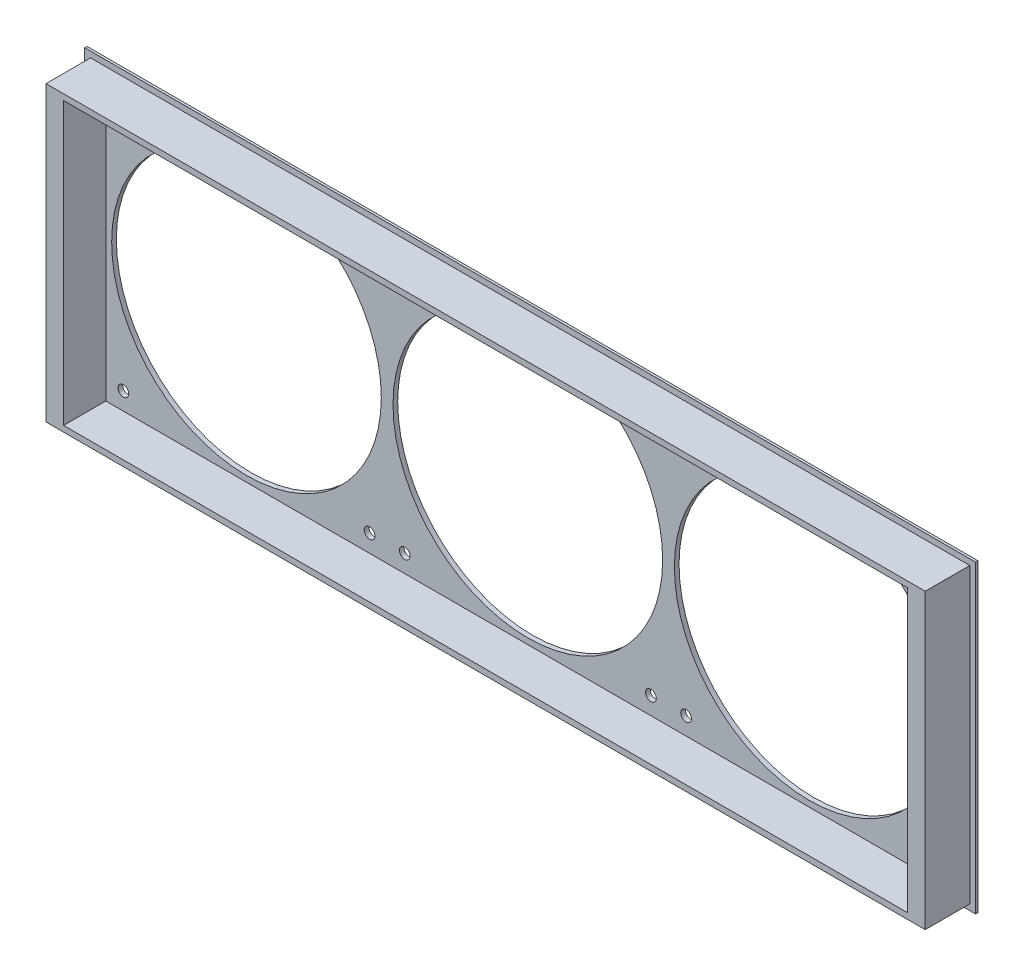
from build123d import *

# Parameters (mm, degrees)
ESQUISSE1_W             = 380
ESQUISSE1_H             = 130
BOSS_EXTRU_1_DEPTH      = 20
ESQUISSE3_W             = 380
ESQUISSE3_H             = 19
ENL_V_MAT_EXTRU_1_DEPTH = 2.5
ESQUISSE4_W             = 19
ESQUISSE4_H             = 127.5
ENL_V_MAT_EXTRU_2_DEPTH = 2.5
ESQUISSE5_W             = 19
ESQUISSE5_H             = 127.5
ENL_V_MAT_EXTRU_3_DEPTH = 2.5
ESQUISSE6_W             = 375
ESQUISSE6_H             = 19
ENL_V_MAT_EXTRU_4_DEPTH = 2.5
ESQUISSE7_W             = 360
ESQUISSE7_H             = 120
ENL_V_MAT_EXTRU_5_DEPTH = 15
ESQUISSE8_R             = 57.5
ENL_V_MAT_EXTRU_6_DEPTH = 15
ESQUISSE9_R             = 2.285
ENL_V_MAT_EXTRU_7_DEPTH = 15
ESQUISSE7_2_W           = 360
ESQUISSE7_2_H           = 120
ENL_V_MAT_EXTRU_8_DEPTH = 18


with BuildPart() as part:
    # Esquisse1 → Boss.-Extru.1 (new body)
    with BuildSketch(Plane.XY):
        with Locations((-11.094890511, 20.291970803)):
            Rectangle(ESQUISSE1_W, ESQUISSE1_H)
    extrude(amount=BOSS_EXTRU_1_DEPTH)

    # Esquisse3 → Enl_v. mat.-Extru.1 (cut)
    with BuildSketch(Plane(origin=(0, 85.291970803, 0), x_dir=(1, 0, 0), z_dir=(0, 1, 0))):
        with Locations((-11.094890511, -10.5)):
            Rectangle(ESQUISSE3_W, ESQUISSE3_H)
    extrude(amount=-ENL_V_MAT_EXTRU_1_DEPTH, mode=Mode.SUBTRACT)

    # Esquisse4 → Enl_v. mat.-Extru.2 (cut)
    with BuildSketch(Plane(origin=(178.905109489, 0, 0), x_dir=(0, 0, -1), z_dir=(1, 0, 0))):
        with Locations((-10.5, 19.041970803)):
            Rectangle(ESQUISSE4_W, ESQUISSE4_H)
    extrude(amount=-ENL_V_MAT_EXTRU_2_DEPTH, mode=Mode.SUBTRACT)

    # Esquisse5 → Enl_v. mat.-Extru.3 (cut)
    with BuildSketch(Plane.ZY.offset(201.094890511)):
        with Locations((10.5, 19.041970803)):
            Rectangle(ESQUISSE5_W, ESQUISSE5_H)
    extrude(amount=-ENL_V_MAT_EXTRU_3_DEPTH, mode=Mode.SUBTRACT)

    # Esquisse6 → Enl_v. mat.-Extru.4 (cut)
    with BuildSketch(Plane.XZ.offset(44.708029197)):
        with Locations((-11.094890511, 10.5)):
            Rectangle(ESQUISSE6_W, ESQUISSE6_H)
    extrude(amount=-ENL_V_MAT_EXTRU_4_DEPTH, mode=Mode.SUBTRACT)

    # Esquisse7 → Enl_v. mat.-Extru.5 (cut)
    with BuildSketch(Plane.XY.offset(20)):
        with Locations((-11.094890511, 20.291970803)):
            Rectangle(ESQUISSE7_W, ESQUISSE7_H)
    extrude(amount=-ENL_V_MAT_EXTRU_5_DEPTH, mode=Mode.SUBTRACT)

    # Esquisse8 → Enl_v. mat.-Extru.6 (cut)
    with BuildSketch(Plane.XY.offset(5)):
        with Locations((-131.094890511, 20.291970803)):
            Circle(ESQUISSE8_R)
        with Locations((-11.094890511, 20.291970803)):
            Circle(ESQUISSE8_R)
        with Locations((108.905109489, 20.291970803)):
            Circle(ESQUISSE8_R)
    extrude(amount=-ENL_V_MAT_EXTRU_6_DEPTH, mode=Mode.SUBTRACT)

    # Esquisse9 → Enl_v. mat.-Extru.7 (cut)
    with BuildSketch(Plane.XY.offset(5)):
        with Locations((-183.594890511, 72.791970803)):
            Circle(ESQUISSE9_R)
        with Locations((-78.594890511, 72.791970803)):
            Circle(ESQUISSE9_R)
        with Locations((-78.594890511, -32.208029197)):
            Circle(ESQUISSE9_R)
        with Locations((-183.594890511, -32.208029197)):
            Circle(ESQUISSE9_R)
        with Locations((-63.594890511, 72.791970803)):
            Circle(ESQUISSE9_R)
        with Locations((41.405109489, 72.791970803)):
            Circle(ESQUISSE9_R)
        with Locations((41.405109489, -32.208029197)):
            Circle(ESQUISSE9_R)
        with Locations((-63.594890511, -32.208029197)):
            Circle(ESQUISSE9_R)
        with Locations((56.405109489, 72.791970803)):
            Circle(ESQUISSE9_R)
        with Locations((161.405109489, 72.791970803)):
            Circle(ESQUISSE9_R)
        with Locations((161.405109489, -32.208029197)):
            Circle(ESQUISSE9_R)
        with Locations((56.405109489, -32.208029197)):
            Circle(ESQUISSE9_R)
    extrude(amount=-ENL_V_MAT_EXTRU_7_DEPTH, mode=Mode.SUBTRACT)

    # Esquisse7_2 → Enl_v. mat.-Extru.8 (cut)
    with BuildSketch(Plane.XY.offset(20)):
        with Locations((-11.094890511, 20.291970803)):
            Rectangle(ESQUISSE7_2_W, ESQUISSE7_2_H)
    extrude(amount=-ENL_V_MAT_EXTRU_8_DEPTH, mode=Mode.SUBTRACT)


solid = part.part
